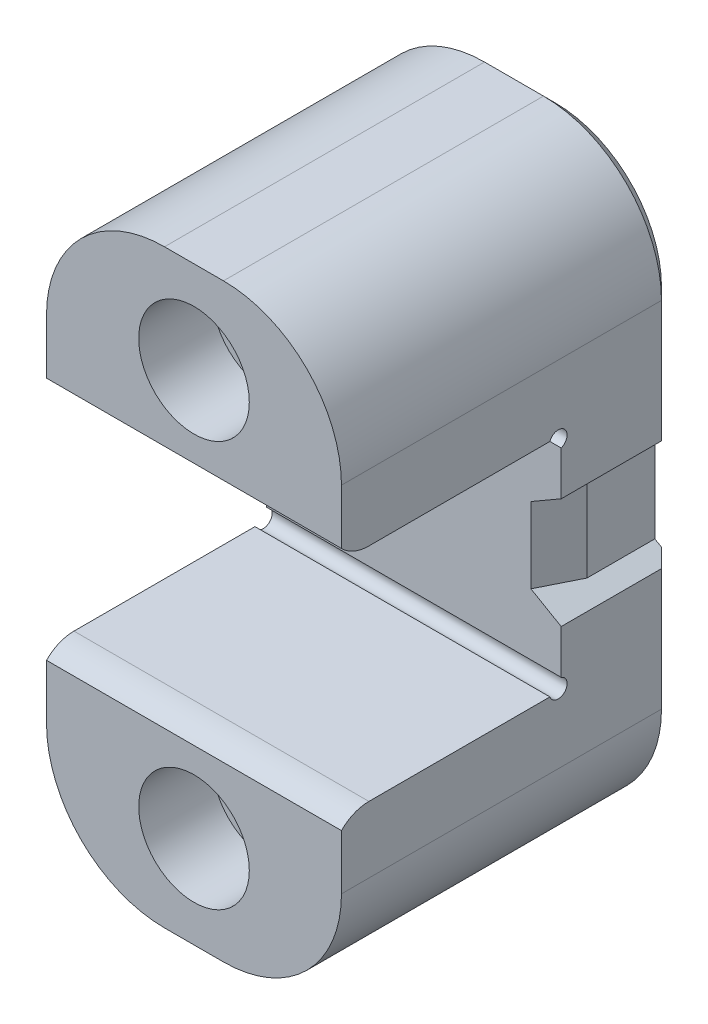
ISO-10303-21;
HEADER;
FILE_DESCRIPTION(('STEP AP214'),'2;1');
FILE_NAME('part.step','',(''),(''),'','','');
FILE_SCHEMA(('AUTOMOTIVE_DESIGN { 1 0 10303 214 1 1 1 1 }'));
ENDSEC;
DATA;
#1=APPLICATION_CONTEXT('core data for automotive mechanical design processes');
#2=APPLICATION_PROTOCOL_DEFINITION('international standard','automotive_design',2000,#1);
#3=PRODUCT_CONTEXT('',#1,'mechanical');
#4=PRODUCT('Part','Part','',(#3));
#5=PRODUCT_RELATED_PRODUCT_CATEGORY('part','',(#4));
#6=PRODUCT_DEFINITION_FORMATION('','',#4);
#7=PRODUCT_DEFINITION_CONTEXT('part definition',#1,'design');
#8=PRODUCT_DEFINITION('design','',#6,#7);
#9=PRODUCT_DEFINITION_SHAPE('','',#8);
#10=(LENGTH_UNIT() NAMED_UNIT(*) SI_UNIT(.MILLI.,.METRE.));
#11=(NAMED_UNIT(*) PLANE_ANGLE_UNIT() SI_UNIT($,.RADIAN.));
#12=(NAMED_UNIT(*) SI_UNIT($,.STERADIAN.) SOLID_ANGLE_UNIT());
#13=UNCERTAINTY_MEASURE_WITH_UNIT(LENGTH_MEASURE(1.E-05),#10,'distance_accuracy_value','');
#14=(GEOMETRIC_REPRESENTATION_CONTEXT(3) GLOBAL_UNCERTAINTY_ASSIGNED_CONTEXT((#13)) GLOBAL_UNIT_ASSIGNED_CONTEXT((#10,
#11,#12)) REPRESENTATION_CONTEXT('',''));
#15=CARTESIAN_POINT('',(0.,0.,0.));
#16=DIRECTION('',(0.,0.,1.));
#17=DIRECTION('',(1.,0.,0.));
#18=AXIS2_PLACEMENT_3D('',#15,#16,#17);
#19=CARTESIAN_POINT('',(12.7,9.525,-18.923));
#20=DIRECTION('',(0.,0.,-1.));
#21=DIRECTION('',(-1.,0.,0.));
#22=AXIS2_PLACEMENT_3D('',#19,#20,#21);
#23=PLANE('',#22);
#24=DIRECTION('',(0.866025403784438,-0.500000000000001,0.));
#25=VECTOR('',#24,1.);
#26=CARTESIAN_POINT('',(6.51333102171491,-1.19062499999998,-18.923));
#27=LINE('',#26,#25);
#28=CARTESIAN_POINT('',(10.0916135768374,-3.25654739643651,-18.923));
#29=VERTEX_POINT('',#28);
#30=CARTESIAN_POINT('',(12.7,-4.76249999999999,-18.923));
#31=VERTEX_POINT('',#30);
#32=EDGE_CURVE('E428',#29,#31,#27,.T.);
#33=ORIENTED_EDGE('',*,*,#32,.F.);
#34=DIRECTION('',(0.,1.,0.));
#35=VECTOR('',#34,1.);
#36=CARTESIAN_POINT('',(10.0916135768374,3.84595644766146,-18.923));
#37=LINE('',#36,#35);
#38=CARTESIAN_POINT('',(10.0916135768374,3.25654739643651,-18.923));
#39=VERTEX_POINT('',#38);
#40=EDGE_CURVE('E286',#29,#39,#37,.T.);
#41=ORIENTED_EDGE('',*,*,#40,.T.);
#42=DIRECTION('',(-0.866025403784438,-0.500000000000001,0.));
#43=VECTOR('',#42,1.);
#44=CARTESIAN_POINT('',(14.7622229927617,5.953125,-18.923));
#45=LINE('',#44,#43);
#46=CARTESIAN_POINT('',(12.7,4.76249999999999,-18.923));
#47=VERTEX_POINT('',#46);
#48=EDGE_CURVE('E426',#47,#39,#45,.T.);
#49=ORIENTED_EDGE('',*,*,#48,.F.);
#50=DIRECTION('',(0.,-1.,0.));
#51=VECTOR('',#50,1.);
#52=CARTESIAN_POINT('',(12.7,9.525,-18.923));
#53=LINE('',#52,#51);
#54=CARTESIAN_POINT('',(12.7,8.55257951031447,-18.923));
#55=VERTEX_POINT('',#54);
#56=EDGE_CURVE('E437',#55,#47,#53,.T.);
#57=ORIENTED_EDGE('',*,*,#56,.F.);
#58=DIRECTION('',(1.,0.,0.));
#59=VECTOR('',#58,1.);
#60=CARTESIAN_POINT('',(-12.7,8.55257951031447,-18.923));
#61=LINE('',#60,#59);
#62=CARTESIAN_POINT('',(-12.7,8.55257951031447,-18.923));
#63=VERTEX_POINT('',#62);
#64=EDGE_CURVE('E392',#55,#63,#61,.F.);
#65=ORIENTED_EDGE('',*,*,#64,.T.);
#66=DIRECTION('',(0.,-1.,0.));
#67=VECTOR('',#66,1.);
#68=CARTESIAN_POINT('',(-12.7,9.525,-18.923));
#69=LINE('',#68,#67);
#70=CARTESIAN_POINT('',(-12.7,-8.55257951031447,-18.923));
#71=VERTEX_POINT('',#70);
#72=EDGE_CURVE('E233',#63,#71,#69,.T.);
#73=ORIENTED_EDGE('',*,*,#72,.T.);
#74=DIRECTION('',(1.,0.,0.));
#75=VECTOR('',#74,1.);
#76=CARTESIAN_POINT('',(-12.7,-8.55257951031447,-18.923));
#77=LINE('',#76,#75);
#78=CARTESIAN_POINT('',(12.7,-8.55257951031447,-18.923));
#79=VERTEX_POINT('',#78);
#80=EDGE_CURVE('E213',#71,#79,#77,.T.);
#81=ORIENTED_EDGE('',*,*,#80,.T.);
#82=EDGE_CURVE('E436',#31,#79,#53,.T.);
#83=ORIENTED_EDGE('',*,*,#82,.F.);
#84=EDGE_LOOP('',(#33,#41,#49,#57,#65,#73,#81,#83));
#85=FACE_BOUND('',#84,.T.);
#86=ADVANCED_FACE('F33',(#85),#23,.F.);
#87=CARTESIAN_POINT('',(12.7,25.4,-28.575));
#88=DIRECTION('',(0.,0.,1.));
#89=DIRECTION('',(1.,0.,0.));
#90=AXIS2_PLACEMENT_3D('',#87,#88,#89);
#91=PLANE('',#90);
#92=DIRECTION('',(0.866025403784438,-0.500000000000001,0.));
#93=VECTOR('',#92,1.);
#94=CARTESIAN_POINT('',(11.1125,-3.84595644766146,-28.575));
#95=LINE('',#94,#93);
#96=CARTESIAN_POINT('',(11.1125,-3.84595644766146,-28.575));
#97=VERTEX_POINT('',#96);
#98=CARTESIAN_POINT('',(11.684,-4.17591212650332,-28.575));
#99=VERTEX_POINT('',#98);
#100=EDGE_CURVE('E416',#97,#99,#95,.T.);
#101=ORIENTED_EDGE('',*,*,#100,.T.);
#102=DIRECTION('',(0.,-1.,0.));
#103=VECTOR('',#102,1.);
#104=CARTESIAN_POINT('',(11.684,25.4,-28.575));
#105=LINE('',#104,#103);
#106=CARTESIAN_POINT('',(11.684,-15.24,-28.575));
#107=VERTEX_POINT('',#106);
#108=EDGE_CURVE('E315',#99,#107,#105,.T.);
#109=ORIENTED_EDGE('',*,*,#108,.T.);
#110=CARTESIAN_POINT('',(2.54,-15.24,-28.575));
#111=DIRECTION('',(0.,0.,1.));
#112=DIRECTION('',(1.,0.,0.));
#113=AXIS2_PLACEMENT_3D('',#110,#111,#112);
#114=CIRCLE('',#113,9.14399999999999);
#115=CARTESIAN_POINT('',(2.54,-24.384,-28.575));
#116=VERTEX_POINT('',#115);
#117=EDGE_CURVE('E311',#107,#116,#114,.F.);
#118=ORIENTED_EDGE('',*,*,#117,.T.);
#119=DIRECTION('',(-1.,0.,0.));
#120=VECTOR('',#119,1.);
#121=CARTESIAN_POINT('',(12.7,-24.384,-28.575));
#122=LINE('',#121,#120);
#123=CARTESIAN_POINT('',(-2.54,-24.384,-28.575));
#124=VERTEX_POINT('',#123);
#125=EDGE_CURVE('E307',#116,#124,#122,.T.);
#126=ORIENTED_EDGE('',*,*,#125,.T.);
#127=CARTESIAN_POINT('',(-2.54,-15.24,-28.575));
#128=DIRECTION('',(0.,0.,1.));
#129=DIRECTION('',(1.,0.,0.));
#130=AXIS2_PLACEMENT_3D('',#127,#128,#129);
#131=CIRCLE('',#130,9.14399999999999);
#132=CARTESIAN_POINT('',(-11.684,-15.24,-28.575));
#133=VERTEX_POINT('',#132);
#134=EDGE_CURVE('E305',#124,#133,#131,.F.);
#135=ORIENTED_EDGE('',*,*,#134,.T.);
#136=DIRECTION('',(0.,1.,0.));
#137=VECTOR('',#136,1.);
#138=CARTESIAN_POINT('',(-11.684,15.24,-28.575));
#139=LINE('',#138,#137);
#140=CARTESIAN_POINT('',(-11.684,15.24,-28.575));
#141=VERTEX_POINT('',#140);
#142=EDGE_CURVE('E301',#133,#141,#139,.T.);
#143=ORIENTED_EDGE('',*,*,#142,.T.);
#144=CARTESIAN_POINT('',(-2.54,15.24,-28.575));
#145=DIRECTION('',(0.,0.,1.));
#146=DIRECTION('',(1.,0.,0.));
#147=AXIS2_PLACEMENT_3D('',#144,#145,#146);
#148=CIRCLE('',#147,9.14399999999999);
#149=CARTESIAN_POINT('',(-2.54,24.384,-28.575));
#150=VERTEX_POINT('',#149);
#151=EDGE_CURVE('E299',#141,#150,#148,.F.);
#152=ORIENTED_EDGE('',*,*,#151,.T.);
#153=DIRECTION('',(1.,0.,0.));
#154=VECTOR('',#153,1.);
#155=CARTESIAN_POINT('',(12.7,24.384,-28.575));
#156=LINE('',#155,#154);
#157=CARTESIAN_POINT('',(2.54,24.384,-28.575));
#158=VERTEX_POINT('',#157);
#159=EDGE_CURVE('E303',#150,#158,#156,.T.);
#160=ORIENTED_EDGE('',*,*,#159,.T.);
#161=CARTESIAN_POINT('',(2.54,15.24,-28.575));
#162=DIRECTION('',(0.,0.,1.));
#163=DIRECTION('',(1.,0.,0.));
#164=AXIS2_PLACEMENT_3D('',#161,#162,#163);
#165=CIRCLE('',#164,9.14399999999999);
#166=CARTESIAN_POINT('',(11.684,15.24,-28.575));
#167=VERTEX_POINT('',#166);
#168=EDGE_CURVE('E309',#158,#167,#165,.F.);
#169=ORIENTED_EDGE('',*,*,#168,.T.);
#170=DIRECTION('',(0.,-1.,0.));
#171=VECTOR('',#170,1.);
#172=CARTESIAN_POINT('',(11.684,25.4,-28.575));
#173=LINE('',#172,#171);
#174=CARTESIAN_POINT('',(11.684,4.17591212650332,-28.575));
#175=VERTEX_POINT('',#174);
#176=EDGE_CURVE('E313',#167,#175,#173,.T.);
#177=ORIENTED_EDGE('',*,*,#176,.T.);
#178=DIRECTION('',(-0.866025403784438,-0.500000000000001,0.));
#179=VECTOR('',#178,1.);
#180=CARTESIAN_POINT('',(11.1125,3.84595644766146,-28.575));
#181=LINE('',#180,#179);
#182=CARTESIAN_POINT('',(11.1125,3.84595644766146,-28.575));
#183=VERTEX_POINT('',#182);
#184=EDGE_CURVE('E419',#175,#183,#181,.T.);
#185=ORIENTED_EDGE('',*,*,#184,.T.);
#186=DIRECTION('',(0.,-1.,0.));
#187=VECTOR('',#186,1.);
#188=CARTESIAN_POINT('',(11.1125,3.84595644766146,-28.575));
#189=LINE('',#188,#187);
#190=EDGE_CURVE('E412',#183,#97,#189,.T.);
#191=ORIENTED_EDGE('',*,*,#190,.T.);
#192=EDGE_LOOP('',(#101,#109,#118,#126,#135,#143,#152,#160,#169,#177,#185,#191));
#193=FACE_BOUND('',#192,.T.);
#194=CARTESIAN_POINT('',(0.,-17.4625,-28.575));
#195=DIRECTION('',(0.,0.,1.));
#196=DIRECTION('',(1.,0.,0.));
#197=AXIS2_PLACEMENT_3D('',#194,#195,#196);
#198=CIRCLE('',#197,2.55269999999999);
#199=CARTESIAN_POINT('',(2.55269999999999,-17.4625,-28.575));
#200=VERTEX_POINT('',#199);
#201=EDGE_CURVE('E360',#200,#200,#198,.T.);
#202=ORIENTED_EDGE('',*,*,#201,.T.);
#203=EDGE_LOOP('',(#202));
#204=FACE_BOUND('',#203,.T.);
#205=CARTESIAN_POINT('',(0.,17.4625,-28.575));
#206=DIRECTION('',(0.,0.,1.));
#207=DIRECTION('',(1.,0.,0.));
#208=AXIS2_PLACEMENT_3D('',#205,#206,#207);
#209=CIRCLE('',#208,2.55269999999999);
#210=CARTESIAN_POINT('',(2.55269999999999,17.4625,-28.575));
#211=VERTEX_POINT('',#210);
#212=EDGE_CURVE('E370',#211,#211,#209,.T.);
#213=ORIENTED_EDGE('',*,*,#212,.T.);
#214=EDGE_LOOP('',(#213));
#215=FACE_BOUND('',#214,.T.);
#216=ADVANCED_FACE('F546',(#193,#204,#215),#91,.F.);
#217=CARTESIAN_POINT('',(12.7,-9.525,0.));
#218=DIRECTION('',(-1.,0.,0.));
#219=DIRECTION('',(0.,0.,1.));
#220=AXIS2_PLACEMENT_3D('',#217,#218,#219);
#221=PLANE('',#220);
#222=DIRECTION('',(0.,0.,-1.));
#223=VECTOR('',#222,1.);
#224=CARTESIAN_POINT('',(12.7,-15.24,0.));
#225=LINE('',#224,#223);
#226=CARTESIAN_POINT('',(12.7,-15.24,0.));
#227=VERTEX_POINT('',#226);
#228=CARTESIAN_POINT('',(12.7,-15.24,-27.559));
#229=VERTEX_POINT('',#228);
#230=EDGE_CURVE('E251',#227,#229,#225,.T.);
#231=ORIENTED_EDGE('',*,*,#230,.T.);
#232=DIRECTION('',(0.,1.,0.));
#233=VECTOR('',#232,1.);
#234=CARTESIAN_POINT('',(12.7,-9.525,-27.559));
#235=LINE('',#234,#233);
#236=CARTESIAN_POINT('',(12.7,-4.76249999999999,-27.559));
#237=VERTEX_POINT('',#236);
#238=EDGE_CURVE('E294',#229,#237,#235,.T.);
#239=ORIENTED_EDGE('',*,*,#238,.T.);
#240=DIRECTION('',(0.,0.,-1.));
#241=VECTOR('',#240,1.);
#242=CARTESIAN_POINT('',(12.7,-4.76249999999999,0.));
#243=LINE('',#242,#241);
#244=EDGE_CURVE('E278',#31,#237,#243,.T.);
#245=ORIENTED_EDGE('',*,*,#244,.F.);
#246=ORIENTED_EDGE('',*,*,#82,.T.);
#247=CARTESIAN_POINT('',(12.7,-9.271,-18.669));
#248=DIRECTION('',(1.,0.,0.));
#249=DIRECTION('',(0.,0.,1.));
#250=AXIS2_PLACEMENT_3D('',#247,#248,#249);
#251=CIRCLE('',#250,0.761999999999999);
#252=CARTESIAN_POINT('',(12.7,-9.525,-17.9505795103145));
#253=VERTEX_POINT('',#252);
#254=EDGE_CURVE('E218',#253,#79,#251,.T.);
#255=ORIENTED_EDGE('',*,*,#254,.F.);
#256=DIRECTION('',(0.,0.,1.));
#257=VECTOR('',#256,1.);
#258=CARTESIAN_POINT('',(12.7,-9.525,-18.923));
#259=LINE('',#258,#257);
#260=CARTESIAN_POINT('',(12.7,-9.525,-2.36219999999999));
#261=VERTEX_POINT('',#260);
#262=EDGE_CURVE('E226',#253,#261,#259,.T.);
#263=ORIENTED_EDGE('',*,*,#262,.T.);
#264=CARTESIAN_POINT('',(12.7,-12.8241534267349,-2.36219999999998));
#265=DIRECTION('',(-1.,0.,0.));
#266=DIRECTION('',(0.,0.,1.));
#267=AXIS2_PLACEMENT_3D('',#264,#265,#266);
#268=CIRCLE('',#267,3.29915342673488);
#269=CARTESIAN_POINT('',(12.7,-10.5210198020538,0.));
#270=VERTEX_POINT('',#269);
#271=EDGE_CURVE('E403',#270,#261,#268,.T.);
#272=ORIENTED_EDGE('',*,*,#271,.F.);
#273=DIRECTION('',(0.,-1.,0.));
#274=VECTOR('',#273,1.);
#275=CARTESIAN_POINT('',(12.7,-9.525,0.));
#276=LINE('',#275,#274);
#277=EDGE_CURVE('E246',#270,#227,#276,.T.);
#278=ORIENTED_EDGE('',*,*,#277,.T.);
#279=EDGE_LOOP('',(#231,#239,#245,#246,#255,#263,#272,#278));
#280=FACE_BOUND('',#279,.T.);
#281=ADVANCED_FACE('F523',(#280),#221,.F.);
#282=DIRECTION('',(0.,0.,1.));
#283=VECTOR('',#282,1.);
#284=CARTESIAN_POINT('',(12.7,4.76249999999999,0.));
#285=LINE('',#284,#283);
#286=CARTESIAN_POINT('',(12.7,4.76249999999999,-27.559));
#287=VERTEX_POINT('',#286);
#288=EDGE_CURVE('E276',#287,#47,#285,.T.);
#289=ORIENTED_EDGE('',*,*,#288,.F.);
#290=DIRECTION('',(0.,1.,0.));
#291=VECTOR('',#290,1.);
#292=CARTESIAN_POINT('',(12.7,-9.525,-27.559));
#293=LINE('',#292,#291);
#294=CARTESIAN_POINT('',(12.7,15.24,-27.559));
#295=VERTEX_POINT('',#294);
#296=EDGE_CURVE('E317',#287,#295,#293,.T.);
#297=ORIENTED_EDGE('',*,*,#296,.T.);
#298=DIRECTION('',(0.,0.,1.));
#299=VECTOR('',#298,1.);
#300=CARTESIAN_POINT('',(12.7,15.24,0.));
#301=LINE('',#300,#299);
#302=CARTESIAN_POINT('',(12.7,15.24,0.));
#303=VERTEX_POINT('',#302);
#304=EDGE_CURVE('E249',#295,#303,#301,.T.);
#305=ORIENTED_EDGE('',*,*,#304,.T.);
#306=DIRECTION('',(0.,-1.,0.));
#307=VECTOR('',#306,1.);
#308=CARTESIAN_POINT('',(12.7,25.4,0.));
#309=LINE('',#308,#307);
#310=CARTESIAN_POINT('',(12.7,10.5210198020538,0.));
#311=VERTEX_POINT('',#310);
#312=EDGE_CURVE('E236',#303,#311,#309,.T.);
#313=ORIENTED_EDGE('',*,*,#312,.T.);
#314=CARTESIAN_POINT('',(12.7,12.8241534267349,-2.36219999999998));
#315=DIRECTION('',(-1.,0.,0.));
#316=DIRECTION('',(0.,0.,-1.));
#317=AXIS2_PLACEMENT_3D('',#314,#315,#316);
#318=CIRCLE('',#317,3.29915342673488);
#319=CARTESIAN_POINT('',(12.7,9.525,-2.36219999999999));
#320=VERTEX_POINT('',#319);
#321=EDGE_CURVE('E395',#320,#311,#318,.T.);
#322=ORIENTED_EDGE('',*,*,#321,.F.);
#323=DIRECTION('',(0.,0.,-1.));
#324=VECTOR('',#323,1.);
#325=CARTESIAN_POINT('',(12.7,9.525,0.));
#326=LINE('',#325,#324);
#327=CARTESIAN_POINT('',(12.7,9.525,-17.9505795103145));
#328=VERTEX_POINT('',#327);
#329=EDGE_CURVE('E433',#320,#328,#326,.T.);
#330=ORIENTED_EDGE('',*,*,#329,.T.);
#331=CARTESIAN_POINT('',(12.7,9.271,-18.669));
#332=DIRECTION('',(1.,0.,0.));
#333=DIRECTION('',(0.,0.,-1.));
#334=AXIS2_PLACEMENT_3D('',#331,#332,#333);
#335=CIRCLE('',#334,0.761999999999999);
#336=EDGE_CURVE('E387',#55,#328,#335,.T.);
#337=ORIENTED_EDGE('',*,*,#336,.F.);
#338=ORIENTED_EDGE('',*,*,#56,.T.);
#339=EDGE_LOOP('',(#289,#297,#305,#313,#322,#330,#337,#338));
#340=FACE_BOUND('',#339,.T.);
#341=ADVANCED_FACE('F459',(#340),#221,.F.);
#342=CARTESIAN_POINT('',(12.7,25.4,0.));
#343=DIRECTION('',(0.,0.,-1.));
#344=DIRECTION('',(0.,1.,0.));
#345=AXIS2_PLACEMENT_3D('',#342,#343,#344);
#346=PLANE('',#345);
#347=CARTESIAN_POINT('',(0.,17.4625,0.));
#348=DIRECTION('',(0.,0.,1.));
#349=DIRECTION('',(1.,0.,0.));
#350=AXIS2_PLACEMENT_3D('',#347,#348,#349);
#351=CIRCLE('',#350,4.7625);
#352=CARTESIAN_POINT('',(4.7625,17.4625,0.));
#353=VERTEX_POINT('',#352);
#354=EDGE_CURVE('E373',#353,#353,#351,.T.);
#355=ORIENTED_EDGE('',*,*,#354,.F.);
#356=EDGE_LOOP('',(#355));
#357=FACE_BOUND('',#356,.T.);
#358=DIRECTION('',(0.,-1.,0.));
#359=VECTOR('',#358,1.);
#360=CARTESIAN_POINT('',(-12.7,25.4,0.));
#361=LINE('',#360,#359);
#362=CARTESIAN_POINT('',(-12.7,15.24,0.));
#363=VERTEX_POINT('',#362);
#364=CARTESIAN_POINT('',(-12.7,10.5210198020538,0.));
#365=VERTEX_POINT('',#364);
#366=EDGE_CURVE('E430',#363,#365,#361,.T.);
#367=ORIENTED_EDGE('',*,*,#366,.T.);
#368=DIRECTION('',(1.,0.,0.));
#369=VECTOR('',#368,1.);
#370=CARTESIAN_POINT('',(-12.7,10.5210198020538,0.));
#371=LINE('',#370,#369);
#372=EDGE_CURVE('E399',#365,#311,#371,.T.);
#373=ORIENTED_EDGE('',*,*,#372,.T.);
#374=ORIENTED_EDGE('',*,*,#312,.F.);
#375=CARTESIAN_POINT('',(2.54,15.24,0.));
#376=DIRECTION('',(0.,0.,-1.));
#377=DIRECTION('',(0.,1.,0.));
#378=AXIS2_PLACEMENT_3D('',#375,#376,#377);
#379=CIRCLE('',#378,10.16);
#380=CARTESIAN_POINT('',(2.54,25.4,0.));
#381=VERTEX_POINT('',#380);
#382=EDGE_CURVE('E266',#303,#381,#379,.F.);
#383=ORIENTED_EDGE('',*,*,#382,.T.);
#384=DIRECTION('',(-1.,0.,0.));
#385=VECTOR('',#384,1.);
#386=CARTESIAN_POINT('',(12.7,25.4,0.));
#387=LINE('',#386,#385);
#388=CARTESIAN_POINT('',(-2.54,25.4,0.));
#389=VERTEX_POINT('',#388);
#390=EDGE_CURVE('E242',#381,#389,#387,.T.);
#391=ORIENTED_EDGE('',*,*,#390,.T.);
#392=CARTESIAN_POINT('',(-2.54,15.24,0.));
#393=DIRECTION('',(0.,0.,-1.));
#394=DIRECTION('',(0.,1.,0.));
#395=AXIS2_PLACEMENT_3D('',#392,#393,#394);
#396=CIRCLE('',#395,10.16);
#397=EDGE_CURVE('E264',#389,#363,#396,.F.);
#398=ORIENTED_EDGE('',*,*,#397,.T.);
#399=EDGE_LOOP('',(#367,#373,#374,#383,#391,#398));
#400=FACE_BOUND('',#399,.T.);
#401=ADVANCED_FACE('F466',(#357,#400),#346,.F.);
#402=CARTESIAN_POINT('',(12.7,9.525,0.));
#403=DIRECTION('',(0.,1.,0.));
#404=DIRECTION('',(0.,0.,1.));
#405=AXIS2_PLACEMENT_3D('',#402,#403,#404);
#406=PLANE('',#405);
#407=DIRECTION('',(0.,0.,-1.));
#408=VECTOR('',#407,1.);
#409=CARTESIAN_POINT('',(-12.7,9.525,0.));
#410=LINE('',#409,#408);
#411=CARTESIAN_POINT('',(-12.7,9.525,-2.36219999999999));
#412=VERTEX_POINT('',#411);
#413=CARTESIAN_POINT('',(-12.7,9.525,-17.9505795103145));
#414=VERTEX_POINT('',#413);
#415=EDGE_CURVE('E238',#412,#414,#410,.T.);
#416=ORIENTED_EDGE('',*,*,#415,.T.);
#417=DIRECTION('',(1.,0.,0.));
#418=VECTOR('',#417,1.);
#419=CARTESIAN_POINT('',(-12.7,9.525,-17.9505795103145));
#420=LINE('',#419,#418);
#421=EDGE_CURVE('E389',#414,#328,#420,.T.);
#422=ORIENTED_EDGE('',*,*,#421,.T.);
#423=ORIENTED_EDGE('',*,*,#329,.F.);
#424=DIRECTION('',(1.,0.,0.));
#425=VECTOR('',#424,1.);
#426=CARTESIAN_POINT('',(-12.7,9.525,-2.36219999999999));
#427=LINE('',#426,#425);
#428=EDGE_CURVE('E401',#412,#320,#427,.T.);
#429=ORIENTED_EDGE('',*,*,#428,.F.);
#430=EDGE_LOOP('',(#416,#422,#423,#429));
#431=FACE_BOUND('',#430,.T.);
#432=ADVANCED_FACE('F447',(#431),#406,.F.);
#433=CARTESIAN_POINT('',(12.7,-9.525,-18.923));
#434=DIRECTION('',(0.,-1.,0.));
#435=DIRECTION('',(0.,0.,-1.));
#436=AXIS2_PLACEMENT_3D('',#433,#434,#435);
#437=PLANE('',#436);
#438=ORIENTED_EDGE('',*,*,#262,.F.);
#439=DIRECTION('',(1.,0.,0.));
#440=VECTOR('',#439,1.);
#441=CARTESIAN_POINT('',(-12.7,-9.525,-17.9505795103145));
#442=LINE('',#441,#440);
#443=CARTESIAN_POINT('',(-12.7,-9.525,-17.9505795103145));
#444=VERTEX_POINT('',#443);
#445=EDGE_CURVE('E210',#253,#444,#442,.F.);
#446=ORIENTED_EDGE('',*,*,#445,.T.);
#447=DIRECTION('',(0.,0.,1.));
#448=VECTOR('',#447,1.);
#449=CARTESIAN_POINT('',(-12.7,-9.525,-18.923));
#450=LINE('',#449,#448);
#451=CARTESIAN_POINT('',(-12.7,-9.525,-2.36219999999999));
#452=VERTEX_POINT('',#451);
#453=EDGE_CURVE('E224',#444,#452,#450,.T.);
#454=ORIENTED_EDGE('',*,*,#453,.T.);
#455=DIRECTION('',(1.,0.,0.));
#456=VECTOR('',#455,1.);
#457=CARTESIAN_POINT('',(-12.7,-9.525,-2.36219999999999));
#458=LINE('',#457,#456);
#459=EDGE_CURVE('E407',#452,#261,#458,.T.);
#460=ORIENTED_EDGE('',*,*,#459,.T.);
#461=EDGE_LOOP('',(#438,#446,#454,#460));
#462=FACE_BOUND('',#461,.T.);
#463=ADVANCED_FACE('F222',(#462),#437,.F.);
#464=CARTESIAN_POINT('',(12.7,-9.525,0.));
#465=DIRECTION('',(0.,0.,-1.));
#466=DIRECTION('',(0.,1.,0.));
#467=AXIS2_PLACEMENT_3D('',#464,#465,#466);
#468=PLANE('',#467);
#469=CARTESIAN_POINT('',(0.,-17.4625,0.));
#470=DIRECTION('',(0.,0.,1.));
#471=DIRECTION('',(1.,0.,0.));
#472=AXIS2_PLACEMENT_3D('',#469,#470,#471);
#473=CIRCLE('',#472,4.7625);
#474=CARTESIAN_POINT('',(4.7625,-17.4625,0.));
#475=VERTEX_POINT('',#474);
#476=EDGE_CURVE('E379',#475,#475,#473,.T.);
#477=ORIENTED_EDGE('',*,*,#476,.F.);
#478=EDGE_LOOP('',(#477));
#479=FACE_BOUND('',#478,.T.);
#480=ORIENTED_EDGE('',*,*,#277,.F.);
#481=DIRECTION('',(1.,0.,0.));
#482=VECTOR('',#481,1.);
#483=CARTESIAN_POINT('',(-12.7,-10.5210198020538,0.));
#484=LINE('',#483,#482);
#485=CARTESIAN_POINT('',(-12.7,-10.5210198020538,0.));
#486=VERTEX_POINT('',#485);
#487=EDGE_CURVE('E410',#486,#270,#484,.T.);
#488=ORIENTED_EDGE('',*,*,#487,.F.);
#489=DIRECTION('',(0.,-1.,0.));
#490=VECTOR('',#489,1.);
#491=CARTESIAN_POINT('',(-12.7,-9.525,0.));
#492=LINE('',#491,#490);
#493=CARTESIAN_POINT('',(-12.7,-15.24,0.));
#494=VERTEX_POINT('',#493);
#495=EDGE_CURVE('E232',#486,#494,#492,.T.);
#496=ORIENTED_EDGE('',*,*,#495,.T.);
#497=CARTESIAN_POINT('',(-2.54,-15.24,0.));
#498=DIRECTION('',(0.,0.,-1.));
#499=DIRECTION('',(0.,1.,0.));
#500=AXIS2_PLACEMENT_3D('',#497,#498,#499);
#501=CIRCLE('',#500,10.16);
#502=CARTESIAN_POINT('',(-2.54,-25.4,0.));
#503=VERTEX_POINT('',#502);
#504=EDGE_CURVE('E259',#494,#503,#501,.F.);
#505=ORIENTED_EDGE('',*,*,#504,.T.);
#506=DIRECTION('',(-1.,0.,0.));
#507=VECTOR('',#506,1.);
#508=CARTESIAN_POINT('',(12.7,-25.4,0.));
#509=LINE('',#508,#507);
#510=CARTESIAN_POINT('',(2.54,-25.4,0.));
#511=VERTEX_POINT('',#510);
#512=EDGE_CURVE('E245',#511,#503,#509,.T.);
#513=ORIENTED_EDGE('',*,*,#512,.F.);
#514=CARTESIAN_POINT('',(2.54,-15.24,0.));
#515=DIRECTION('',(0.,0.,-1.));
#516=DIRECTION('',(0.,1.,0.));
#517=AXIS2_PLACEMENT_3D('',#514,#515,#516);
#518=CIRCLE('',#517,10.16);
#519=EDGE_CURVE('E261',#511,#227,#518,.F.);
#520=ORIENTED_EDGE('',*,*,#519,.T.);
#521=EDGE_LOOP('',(#480,#488,#496,#505,#513,#520));
#522=FACE_BOUND('',#521,.T.);
#523=ADVANCED_FACE('F497',(#479,#522),#468,.F.);
#524=CARTESIAN_POINT('',(12.7,-25.4,0.));
#525=DIRECTION('',(0.,1.,0.));
#526=DIRECTION('',(0.,0.,1.));
#527=AXIS2_PLACEMENT_3D('',#524,#525,#526);
#528=PLANE('',#527);
#529=DIRECTION('',(0.,0.,-1.));
#530=VECTOR('',#529,1.);
#531=CARTESIAN_POINT('',(-2.54,-25.4,-28.575));
#532=LINE('',#531,#530);
#533=CARTESIAN_POINT('',(-2.54,-25.4,-27.559));
#534=VERTEX_POINT('',#533);
#535=EDGE_CURVE('E254',#503,#534,#532,.T.);
#536=ORIENTED_EDGE('',*,*,#535,.T.);
#537=DIRECTION('',(1.,0.,0.));
#538=VECTOR('',#537,1.);
#539=CARTESIAN_POINT('',(12.7,-25.4,-27.559));
#540=LINE('',#539,#538);
#541=CARTESIAN_POINT('',(2.54,-25.4,-27.559));
#542=VERTEX_POINT('',#541);
#543=EDGE_CURVE('E325',#534,#542,#540,.T.);
#544=ORIENTED_EDGE('',*,*,#543,.T.);
#545=DIRECTION('',(0.,0.,-1.));
#546=VECTOR('',#545,1.);
#547=CARTESIAN_POINT('',(2.54,-25.4,0.));
#548=LINE('',#547,#546);
#549=EDGE_CURVE('E257',#542,#511,#548,.F.);
#550=ORIENTED_EDGE('',*,*,#549,.T.);
#551=ORIENTED_EDGE('',*,*,#512,.T.);
#552=EDGE_LOOP('',(#536,#544,#550,#551));
#553=FACE_BOUND('',#552,.T.);
#554=ADVANCED_FACE('F501',(#553),#528,.F.);
#555=CARTESIAN_POINT('',(12.7,25.4,0.));
#556=DIRECTION('',(0.,-1.,0.));
#557=DIRECTION('',(0.,0.,-1.));
#558=AXIS2_PLACEMENT_3D('',#555,#556,#557);
#559=PLANE('',#558);
#560=DIRECTION('',(0.,0.,1.));
#561=VECTOR('',#560,1.);
#562=CARTESIAN_POINT('',(2.54,25.4,0.));
#563=LINE('',#562,#561);
#564=CARTESIAN_POINT('',(2.54,25.4,-27.559));
#565=VERTEX_POINT('',#564);
#566=EDGE_CURVE('E270',#381,#565,#563,.F.);
#567=ORIENTED_EDGE('',*,*,#566,.T.);
#568=DIRECTION('',(-1.,0.,0.));
#569=VECTOR('',#568,1.);
#570=CARTESIAN_POINT('',(12.7,25.4,-27.559));
#571=LINE('',#570,#569);
#572=CARTESIAN_POINT('',(-2.54,25.4,-27.559));
#573=VERTEX_POINT('',#572);
#574=EDGE_CURVE('E56',#565,#573,#571,.T.);
#575=ORIENTED_EDGE('',*,*,#574,.T.);
#576=DIRECTION('',(0.,0.,1.));
#577=VECTOR('',#576,1.);
#578=CARTESIAN_POINT('',(-2.54,25.4,0.));
#579=LINE('',#578,#577);
#580=EDGE_CURVE('E268',#573,#389,#579,.T.);
#581=ORIENTED_EDGE('',*,*,#580,.T.);
#582=ORIENTED_EDGE('',*,*,#390,.F.);
#583=EDGE_LOOP('',(#567,#575,#581,#582));
#584=FACE_BOUND('',#583,.T.);
#585=ADVANCED_FACE('F474',(#584),#559,.F.);
#586=CARTESIAN_POINT('',(-12.7,-9.525,0.));
#587=DIRECTION('',(-1.,0.,0.));
#588=DIRECTION('',(0.,0.,1.));
#589=AXIS2_PLACEMENT_3D('',#586,#587,#588);
#590=PLANE('',#589);
#591=DIRECTION('',(0.,0.,1.));
#592=VECTOR('',#591,1.);
#593=CARTESIAN_POINT('',(-12.7,15.24,-28.575));
#594=LINE('',#593,#592);
#595=CARTESIAN_POINT('',(-12.7,15.24,-27.559));
#596=VERTEX_POINT('',#595);
#597=EDGE_CURVE('E272',#363,#596,#594,.F.);
#598=ORIENTED_EDGE('',*,*,#597,.T.);
#599=DIRECTION('',(0.,-1.,0.));
#600=VECTOR('',#599,1.);
#601=CARTESIAN_POINT('',(-12.7,-15.24,-27.559));
#602=LINE('',#601,#600);
#603=CARTESIAN_POINT('',(-12.7,-15.24,-27.559));
#604=VERTEX_POINT('',#603);
#605=EDGE_CURVE('E42',#596,#604,#602,.T.);
#606=ORIENTED_EDGE('',*,*,#605,.T.);
#607=DIRECTION('',(0.,0.,-1.));
#608=VECTOR('',#607,1.);
#609=CARTESIAN_POINT('',(-12.7,-15.24,0.));
#610=LINE('',#609,#608);
#611=EDGE_CURVE('E274',#604,#494,#610,.F.);
#612=ORIENTED_EDGE('',*,*,#611,.T.);
#613=ORIENTED_EDGE('',*,*,#495,.F.);
#614=CARTESIAN_POINT('',(-12.7,-12.8241534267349,-2.36219999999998));
#615=DIRECTION('',(-1.,0.,0.));
#616=DIRECTION('',(0.,0.,1.));
#617=AXIS2_PLACEMENT_3D('',#614,#615,#616);
#618=CIRCLE('',#617,3.29915342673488);
#619=EDGE_CURVE('E231',#486,#452,#618,.T.);
#620=ORIENTED_EDGE('',*,*,#619,.T.);
#621=ORIENTED_EDGE('',*,*,#453,.F.);
#622=CARTESIAN_POINT('',(-12.7,-9.271,-18.669));
#623=DIRECTION('',(1.,0.,0.));
#624=DIRECTION('',(0.,0.,1.));
#625=AXIS2_PLACEMENT_3D('',#622,#623,#624);
#626=CIRCLE('',#625,0.761999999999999);
#627=EDGE_CURVE('E207',#444,#71,#626,.T.);
#628=ORIENTED_EDGE('',*,*,#627,.T.);
#629=ORIENTED_EDGE('',*,*,#72,.F.);
#630=CARTESIAN_POINT('',(-12.7,9.271,-18.669));
#631=DIRECTION('',(-1.,0.,0.));
#632=DIRECTION('',(0.,0.,1.));
#633=AXIS2_PLACEMENT_3D('',#630,#631,#632);
#634=CIRCLE('',#633,0.761999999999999);
#635=EDGE_CURVE('E281',#414,#63,#634,.T.);
#636=ORIENTED_EDGE('',*,*,#635,.F.);
#637=ORIENTED_EDGE('',*,*,#415,.F.);
#638=CARTESIAN_POINT('',(-12.7,12.8241534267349,-2.36219999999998));
#639=DIRECTION('',(-1.,0.,0.));
#640=DIRECTION('',(0.,0.,-1.));
#641=AXIS2_PLACEMENT_3D('',#638,#639,#640);
#642=CIRCLE('',#641,3.29915342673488);
#643=EDGE_CURVE('E396',#412,#365,#642,.T.);
#644=ORIENTED_EDGE('',*,*,#643,.T.);
#645=ORIENTED_EDGE('',*,*,#366,.F.);
#646=EDGE_LOOP('',(#598,#606,#612,#613,#620,#621,#628,#629,#636,#637,#644,#645));
#647=FACE_BOUND('',#646,.T.);
#648=ADVANCED_FACE('F229',(#647),#590,.T.);
#649=CARTESIAN_POINT('',(2.54,-15.24,0.));
#650=DIRECTION('',(0.,0.,-1.));
#651=DIRECTION('',(-1.,0.,0.));
#652=AXIS2_PLACEMENT_3D('',#649,#650,#651);
#653=CYLINDRICAL_SURFACE('',#652,10.16);
#654=ORIENTED_EDGE('',*,*,#549,.F.);
#655=CARTESIAN_POINT('',(2.54,-15.24,-27.559));
#656=DIRECTION('',(0.,0.,1.));
#657=DIRECTION('',(1.,0.,0.));
#658=AXIS2_PLACEMENT_3D('',#655,#656,#657);
#659=CIRCLE('',#658,10.16);
#660=EDGE_CURVE('E321',#542,#229,#659,.T.);
#661=ORIENTED_EDGE('',*,*,#660,.T.);
#662=ORIENTED_EDGE('',*,*,#230,.F.);
#663=ORIENTED_EDGE('',*,*,#519,.F.);
#664=EDGE_LOOP('',(#654,#661,#662,#663));
#665=FACE_BOUND('',#664,.T.);
#666=ADVANCED_FACE('F507',(#665),#653,.T.);
#667=CARTESIAN_POINT('',(2.54,15.24,0.));
#668=DIRECTION('',(0.,0.,1.));
#669=DIRECTION('',(1.,0.,0.));
#670=AXIS2_PLACEMENT_3D('',#667,#668,#669);
#671=CYLINDRICAL_SURFACE('',#670,10.16);
#672=ORIENTED_EDGE('',*,*,#304,.F.);
#673=CARTESIAN_POINT('',(2.54,15.24,-27.559));
#674=DIRECTION('',(0.,0.,1.));
#675=DIRECTION('',(1.,0.,0.));
#676=AXIS2_PLACEMENT_3D('',#673,#674,#675);
#677=CIRCLE('',#676,10.16);
#678=EDGE_CURVE('E323',#295,#565,#677,.T.);
#679=ORIENTED_EDGE('',*,*,#678,.T.);
#680=ORIENTED_EDGE('',*,*,#566,.F.);
#681=ORIENTED_EDGE('',*,*,#382,.F.);
#682=EDGE_LOOP('',(#672,#679,#680,#681));
#683=FACE_BOUND('',#682,.T.);
#684=ADVANCED_FACE('F477',(#683),#671,.T.);
#685=CARTESIAN_POINT('',(-2.54,-15.24,0.));
#686=DIRECTION('',(0.,0.,1.));
#687=DIRECTION('',(1.,0.,0.));
#688=AXIS2_PLACEMENT_3D('',#685,#686,#687);
#689=CYLINDRICAL_SURFACE('',#688,10.16);
#690=ORIENTED_EDGE('',*,*,#611,.F.);
#691=CARTESIAN_POINT('',(-2.54,-15.24,-27.559));
#692=DIRECTION('',(0.,0.,1.));
#693=DIRECTION('',(1.,0.,0.));
#694=AXIS2_PLACEMENT_3D('',#691,#692,#693);
#695=CIRCLE('',#694,10.16);
#696=EDGE_CURVE('E327',#604,#534,#695,.T.);
#697=ORIENTED_EDGE('',*,*,#696,.T.);
#698=ORIENTED_EDGE('',*,*,#535,.F.);
#699=ORIENTED_EDGE('',*,*,#504,.F.);
#700=EDGE_LOOP('',(#690,#697,#698,#699));
#701=FACE_BOUND('',#700,.T.);
#702=ADVANCED_FACE('F492',(#701),#689,.T.);
#703=CARTESIAN_POINT('',(-2.54,15.24,0.));
#704=DIRECTION('',(0.,0.,-1.));
#705=DIRECTION('',(-1.,0.,0.));
#706=AXIS2_PLACEMENT_3D('',#703,#704,#705);
#707=CYLINDRICAL_SURFACE('',#706,10.16);
#708=ORIENTED_EDGE('',*,*,#580,.F.);
#709=CARTESIAN_POINT('',(-2.54,15.24,-27.559));
#710=DIRECTION('',(0.,0.,1.));
#711=DIRECTION('',(1.,0.,0.));
#712=AXIS2_PLACEMENT_3D('',#709,#710,#711);
#713=CIRCLE('',#712,10.16);
#714=EDGE_CURVE('E11',#573,#596,#713,.T.);
#715=ORIENTED_EDGE('',*,*,#714,.T.);
#716=ORIENTED_EDGE('',*,*,#597,.F.);
#717=ORIENTED_EDGE('',*,*,#397,.F.);
#718=EDGE_LOOP('',(#708,#715,#716,#717));
#719=FACE_BOUND('',#718,.T.);
#720=ADVANCED_FACE('F469',(#719),#707,.T.);
#721=CARTESIAN_POINT('',(11.1125,3.84595644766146,0.));
#722=DIRECTION('',(1.,0.,0.));
#723=DIRECTION('',(0.,0.,-1.));
#724=AXIS2_PLACEMENT_3D('',#721,#722,#723);
#725=PLANE('',#724);
#726=DIRECTION('',(0.,0.,-1.));
#727=VECTOR('',#726,1.);
#728=CARTESIAN_POINT('',(11.1125,3.84595644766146,0.));
#729=LINE('',#728,#727);
#730=CARTESIAN_POINT('',(11.1125,3.84595644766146,-22.7330000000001));
#731=VERTEX_POINT('',#730);
#732=EDGE_CURVE('E421',#731,#183,#729,.T.);
#733=ORIENTED_EDGE('',*,*,#732,.F.);
#734=DIRECTION('',(0.,-1.,0.));
#735=VECTOR('',#734,1.);
#736=CARTESIAN_POINT('',(11.1125,-3.84595644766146,-22.7330000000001));
#737=LINE('',#736,#735);
#738=CARTESIAN_POINT('',(11.1125,-3.84595644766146,-22.7330000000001));
#739=VERTEX_POINT('',#738);
#740=EDGE_CURVE('E283',#731,#739,#737,.T.);
#741=ORIENTED_EDGE('',*,*,#740,.T.);
#742=DIRECTION('',(0.,0.,-1.));
#743=VECTOR('',#742,1.);
#744=CARTESIAN_POINT('',(11.1125,-3.84595644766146,0.));
#745=LINE('',#744,#743);
#746=EDGE_CURVE('E424',#739,#97,#745,.T.);
#747=ORIENTED_EDGE('',*,*,#746,.T.);
#748=ORIENTED_EDGE('',*,*,#190,.F.);
#749=EDGE_LOOP('',(#733,#741,#747,#748));
#750=FACE_BOUND('',#749,.T.);
#751=ADVANCED_FACE('F569',(#750),#725,.T.);
#752=CARTESIAN_POINT('',(11.1125,-3.84595644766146,0.));
#753=DIRECTION('',(0.500000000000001,0.866025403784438,0.));
#754=DIRECTION('',(-0.866025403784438,0.500000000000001,0.));
#755=AXIS2_PLACEMENT_3D('',#752,#753,#754);
#756=PLANE('',#755);
#757=ORIENTED_EDGE('',*,*,#244,.T.);
#758=DIRECTION('',(0.654653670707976,-0.377964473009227,0.654653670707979));
#759=VECTOR('',#758,1.);
#760=CARTESIAN_POINT('',(23.6038571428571,-11.0578448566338,-16.6551428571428));
#761=LINE('',#760,#759);
#762=EDGE_CURVE('E297',#237,#99,#761,.F.);
#763=ORIENTED_EDGE('',*,*,#762,.T.);
#764=ORIENTED_EDGE('',*,*,#100,.F.);
#765=ORIENTED_EDGE('',*,*,#746,.F.);
#766=DIRECTION('',(-0.255976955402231,0.147788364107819,0.955319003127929));
#767=VECTOR('',#766,1.);
#768=CARTESIAN_POINT('',(10.8215117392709,-3.67795429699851,-21.647017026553));
#769=LINE('',#768,#767);
#770=EDGE_CURVE('E289',#739,#29,#769,.T.);
#771=ORIENTED_EDGE('',*,*,#770,.T.);
#772=ORIENTED_EDGE('',*,*,#32,.T.);
#773=EDGE_LOOP('',(#757,#763,#764,#765,#771,#772));
#774=FACE_BOUND('',#773,.T.);
#775=ADVANCED_FACE('F527',(#774),#756,.T.);
#776=CARTESIAN_POINT('',(11.1125,3.84595644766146,0.));
#777=DIRECTION('',(0.500000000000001,-0.866025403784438,0.));
#778=DIRECTION('',(0.866025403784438,0.500000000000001,0.));
#779=AXIS2_PLACEMENT_3D('',#776,#777,#778);
#780=PLANE('',#779);
#781=ORIENTED_EDGE('',*,*,#184,.F.);
#782=DIRECTION('',(-0.654653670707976,-0.377964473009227,-0.654653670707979));
#783=VECTOR('',#782,1.);
#784=CARTESIAN_POINT('',(23.6038571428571,11.0578448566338,-16.6551428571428));
#785=LINE('',#784,#783);
#786=EDGE_CURVE('E319',#175,#287,#785,.F.);
#787=ORIENTED_EDGE('',*,*,#786,.T.);
#788=ORIENTED_EDGE('',*,*,#288,.T.);
#789=ORIENTED_EDGE('',*,*,#48,.T.);
#790=DIRECTION('',(0.255976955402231,0.147788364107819,-0.955319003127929));
#791=VECTOR('',#790,1.);
#792=CARTESIAN_POINT('',(11.1125,3.84595644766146,-22.7330000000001));
#793=LINE('',#792,#791);
#794=EDGE_CURVE('E292',#39,#731,#793,.T.);
#795=ORIENTED_EDGE('',*,*,#794,.T.);
#796=ORIENTED_EDGE('',*,*,#732,.T.);
#797=EDGE_LOOP('',(#781,#787,#788,#789,#795,#796));
#798=FACE_BOUND('',#797,.T.);
#799=ADVANCED_FACE('F536',(#798),#780,.T.);
#800=CARTESIAN_POINT('',(-12.7,-12.8241534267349,-2.36219999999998));
#801=DIRECTION('',(1.,0.,0.));
#802=DIRECTION('',(0.,0.,-1.));
#803=AXIS2_PLACEMENT_3D('',#800,#801,#802);
#804=CYLINDRICAL_SURFACE('',#803,3.29915342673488);
#805=ORIENTED_EDGE('',*,*,#271,.T.);
#806=ORIENTED_EDGE('',*,*,#459,.F.);
#807=ORIENTED_EDGE('',*,*,#619,.F.);
#808=ORIENTED_EDGE('',*,*,#487,.T.);
#809=EDGE_LOOP('',(#805,#806,#807,#808));
#810=FACE_BOUND('',#809,.T.);
#811=ADVANCED_FACE('F534',(#810),#804,.T.);
#812=CARTESIAN_POINT('',(-12.7,12.8241534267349,-2.36219999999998));
#813=DIRECTION('',(1.,0.,0.));
#814=DIRECTION('',(0.,0.,-1.));
#815=AXIS2_PLACEMENT_3D('',#812,#813,#814);
#816=CYLINDRICAL_SURFACE('',#815,3.29915342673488);
#817=ORIENTED_EDGE('',*,*,#321,.T.);
#818=ORIENTED_EDGE('',*,*,#372,.F.);
#819=ORIENTED_EDGE('',*,*,#643,.F.);
#820=ORIENTED_EDGE('',*,*,#428,.T.);
#821=EDGE_LOOP('',(#817,#818,#819,#820));
#822=FACE_BOUND('',#821,.T.);
#823=ADVANCED_FACE('F464',(#822),#816,.T.);
#824=CARTESIAN_POINT('',(-12.7,9.271,-18.669));
#825=DIRECTION('',(1.,0.,0.));
#826=DIRECTION('',(0.,0.,-1.));
#827=AXIS2_PLACEMENT_3D('',#824,#825,#826);
#828=CYLINDRICAL_SURFACE('',#827,0.761999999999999);
#829=ORIENTED_EDGE('',*,*,#336,.T.);
#830=ORIENTED_EDGE('',*,*,#421,.F.);
#831=ORIENTED_EDGE('',*,*,#635,.T.);
#832=ORIENTED_EDGE('',*,*,#64,.F.);
#833=EDGE_LOOP('',(#829,#830,#831,#832));
#834=FACE_BOUND('',#833,.T.);
#835=ADVANCED_FACE('F452',(#834),#828,.F.);
#836=CARTESIAN_POINT('',(-12.7,-9.271,-18.669));
#837=DIRECTION('',(1.,0.,0.));
#838=DIRECTION('',(0.,0.,-1.));
#839=AXIS2_PLACEMENT_3D('',#836,#837,#838);
#840=CYLINDRICAL_SURFACE('',#839,0.761999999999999);
#841=ORIENTED_EDGE('',*,*,#627,.F.);
#842=ORIENTED_EDGE('',*,*,#445,.F.);
#843=ORIENTED_EDGE('',*,*,#254,.T.);
#844=ORIENTED_EDGE('',*,*,#80,.F.);
#845=EDGE_LOOP('',(#841,#842,#843,#844));
#846=FACE_BOUND('',#845,.T.);
#847=ADVANCED_FACE('F209',(#846),#840,.F.);
#848=CARTESIAN_POINT('',(2.286,-17.4625,-6.35));
#849=DIRECTION('',(0.,0.,-1.));
#850=DIRECTION('',(-1.,0.,0.));
#851=AXIS2_PLACEMENT_3D('',#848,#849,#850);
#852=PLANE('',#851);
#853=CARTESIAN_POINT('',(0.,-17.4625,-6.35));
#854=DIRECTION('',(0.,0.,1.));
#855=DIRECTION('',(1.,0.,0.));
#856=AXIS2_PLACEMENT_3D('',#853,#854,#855);
#857=CIRCLE('',#856,2.55269999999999);
#858=CARTESIAN_POINT('',(2.55269999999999,-17.4625,-6.35));
#859=VERTEX_POINT('',#858);
#860=EDGE_CURVE('E354',#859,#859,#857,.T.);
#861=ORIENTED_EDGE('',*,*,#860,.F.);
#862=EDGE_LOOP('',(#861));
#863=FACE_BOUND('',#862,.T.);
#864=CARTESIAN_POINT('',(0.,-17.4625,-6.35));
#865=DIRECTION('',(0.,0.,1.));
#866=DIRECTION('',(1.,0.,0.));
#867=AXIS2_PLACEMENT_3D('',#864,#865,#866);
#868=CIRCLE('',#867,4.7625);
#869=CARTESIAN_POINT('',(4.7625,-17.4625,-6.35));
#870=VERTEX_POINT('',#869);
#871=EDGE_CURVE('E382',#870,#870,#868,.T.);
#872=ORIENTED_EDGE('',*,*,#871,.T.);
#873=EDGE_LOOP('',(#872));
#874=FACE_BOUND('',#873,.T.);
#875=ADVANCED_FACE('F630',(#863,#874),#852,.F.);
#876=CARTESIAN_POINT('',(0.,-17.4625,0.));
#877=DIRECTION('',(0.,0.,1.));
#878=DIRECTION('',(1.,0.,0.));
#879=AXIS2_PLACEMENT_3D('',#876,#877,#878);
#880=CYLINDRICAL_SURFACE('',#879,4.7625);
#881=ORIENTED_EDGE('',*,*,#871,.F.);
#882=EDGE_LOOP('',(#881));
#883=FACE_BOUND('',#882,.T.);
#884=ORIENTED_EDGE('',*,*,#476,.T.);
#885=EDGE_LOOP('',(#884));
#886=FACE_BOUND('',#885,.T.);
#887=ADVANCED_FACE('F627',(#883,#886),#880,.F.);
#888=CARTESIAN_POINT('',(2.286,17.4625,-6.35));
#889=DIRECTION('',(0.,0.,-1.));
#890=DIRECTION('',(-1.,0.,0.));
#891=AXIS2_PLACEMENT_3D('',#888,#889,#890);
#892=PLANE('',#891);
#893=CARTESIAN_POINT('',(0.,17.4625,-6.35));
#894=DIRECTION('',(0.,0.,1.));
#895=DIRECTION('',(1.,0.,0.));
#896=AXIS2_PLACEMENT_3D('',#893,#894,#895);
#897=CIRCLE('',#896,2.55269999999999);
#898=CARTESIAN_POINT('',(2.55269999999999,17.4625,-6.35));
#899=VERTEX_POINT('',#898);
#900=EDGE_CURVE('E365',#899,#899,#897,.T.);
#901=ORIENTED_EDGE('',*,*,#900,.F.);
#902=EDGE_LOOP('',(#901));
#903=FACE_BOUND('',#902,.T.);
#904=CARTESIAN_POINT('',(0.,17.4625,-6.35));
#905=DIRECTION('',(0.,0.,1.));
#906=DIRECTION('',(1.,0.,0.));
#907=AXIS2_PLACEMENT_3D('',#904,#905,#906);
#908=CIRCLE('',#907,4.7625);
#909=CARTESIAN_POINT('',(4.7625,17.4625,-6.35));
#910=VERTEX_POINT('',#909);
#911=EDGE_CURVE('E376',#910,#910,#908,.T.);
#912=ORIENTED_EDGE('',*,*,#911,.T.);
#913=EDGE_LOOP('',(#912));
#914=FACE_BOUND('',#913,.T.);
#915=ADVANCED_FACE('F629',(#903,#914),#892,.F.);
#916=CARTESIAN_POINT('',(0.,17.4625,0.));
#917=DIRECTION('',(0.,0.,1.));
#918=DIRECTION('',(1.,0.,0.));
#919=AXIS2_PLACEMENT_3D('',#916,#917,#918);
#920=CYLINDRICAL_SURFACE('',#919,4.7625);
#921=ORIENTED_EDGE('',*,*,#911,.F.);
#922=EDGE_LOOP('',(#921));
#923=FACE_BOUND('',#922,.T.);
#924=ORIENTED_EDGE('',*,*,#354,.T.);
#925=EDGE_LOOP('',(#924));
#926=FACE_BOUND('',#925,.T.);
#927=ADVANCED_FACE('F637',(#923,#926),#920,.F.);
#928=CARTESIAN_POINT('',(0.,17.4625,-6.35));
#929=DIRECTION('',(0.,0.,1.));
#930=DIRECTION('',(1.,0.,0.));
#931=AXIS2_PLACEMENT_3D('',#928,#929,#930);
#932=CYLINDRICAL_SURFACE('',#931,2.55269999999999);
#933=ORIENTED_EDGE('',*,*,#212,.F.);
#934=EDGE_LOOP('',(#933));
#935=FACE_BOUND('',#934,.T.);
#936=ORIENTED_EDGE('',*,*,#900,.T.);
#937=EDGE_LOOP('',(#936));
#938=FACE_BOUND('',#937,.T.);
#939=ADVANCED_FACE('F678',(#935,#938),#932,.F.);
#940=CARTESIAN_POINT('',(0.,-17.4625,-6.35));
#941=DIRECTION('',(0.,0.,1.));
#942=DIRECTION('',(1.,0.,0.));
#943=AXIS2_PLACEMENT_3D('',#940,#941,#942);
#944=CYLINDRICAL_SURFACE('',#943,2.55269999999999);
#945=ORIENTED_EDGE('',*,*,#201,.F.);
#946=EDGE_LOOP('',(#945));
#947=FACE_BOUND('',#946,.T.);
#948=ORIENTED_EDGE('',*,*,#860,.T.);
#949=EDGE_LOOP('',(#948));
#950=FACE_BOUND('',#949,.T.);
#951=ADVANCED_FACE('F573',(#947,#950),#944,.F.);
#952=CARTESIAN_POINT('',(11.1125,3.84595644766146,-22.7330000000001));
#953=DIRECTION('',(0.965925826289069,0.,0.258819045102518));
#954=DIRECTION('',(0.258819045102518,0.,-0.965925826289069));
#955=AXIS2_PLACEMENT_3D('',#952,#953,#954);
#956=PLANE('',#955);
#957=ORIENTED_EDGE('',*,*,#794,.F.);
#958=ORIENTED_EDGE('',*,*,#40,.F.);
#959=ORIENTED_EDGE('',*,*,#770,.F.);
#960=ORIENTED_EDGE('',*,*,#740,.F.);
#961=EDGE_LOOP('',(#957,#958,#959,#960));
#962=FACE_BOUND('',#961,.T.);
#963=ADVANCED_FACE('F570',(#962),#956,.T.);
#964=CARTESIAN_POINT('',(12.7,-9.525,-27.559));
#965=DIRECTION('',(-0.707106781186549,0.,0.707106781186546));
#966=DIRECTION('',(0.707106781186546,0.,0.707106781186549));
#967=AXIS2_PLACEMENT_3D('',#964,#965,#966);
#968=PLANE('',#967);
#969=ORIENTED_EDGE('',*,*,#786,.F.);
#970=ORIENTED_EDGE('',*,*,#176,.F.);
#971=DIRECTION('',(-0.707106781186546,0.,-0.707106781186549));
#972=VECTOR('',#971,1.);
#973=CARTESIAN_POINT('',(12.7,15.24,-27.559));
#974=LINE('',#973,#972);
#975=EDGE_CURVE('E37',#295,#167,#974,.T.);
#976=ORIENTED_EDGE('',*,*,#975,.F.);
#977=ORIENTED_EDGE('',*,*,#296,.F.);
#978=EDGE_LOOP('',(#969,#970,#976,#977));
#979=FACE_BOUND('',#978,.T.);
#980=ADVANCED_FACE('F35',(#979),#968,.F.);
#981=CARTESIAN_POINT('',(2.54,15.24,-28.575));
#982=DIRECTION('',(0.,0.,1.));
#983=DIRECTION('',(1.,0.,0.));
#984=AXIS2_PLACEMENT_3D('',#981,#982,#983);
#985=CONICAL_SURFACE('',#984,9.14399999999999,0.785398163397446);
#986=ORIENTED_EDGE('',*,*,#975,.T.);
#987=ORIENTED_EDGE('',*,*,#168,.F.);
#988=DIRECTION('',(0.,-0.707106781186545,-0.70710678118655));
#989=VECTOR('',#988,1.);
#990=CARTESIAN_POINT('',(2.54,25.4,-27.559));
#991=LINE('',#990,#989);
#992=EDGE_CURVE('E348',#565,#158,#991,.T.);
#993=ORIENTED_EDGE('',*,*,#992,.F.);
#994=ORIENTED_EDGE('',*,*,#678,.F.);
#995=EDGE_LOOP('',(#986,#987,#993,#994));
#996=FACE_BOUND('',#995,.T.);
#997=ADVANCED_FACE('F478',(#996),#985,.T.);
#998=CARTESIAN_POINT('',(12.7,25.4,-27.559));
#999=DIRECTION('',(0.,-0.70710678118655,0.707106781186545));
#1000=DIRECTION('',(0.,-0.707106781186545,-0.70710678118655));
#1001=AXIS2_PLACEMENT_3D('',#998,#999,#1000);
#1002=PLANE('',#1001);
#1003=ORIENTED_EDGE('',*,*,#992,.T.);
#1004=ORIENTED_EDGE('',*,*,#159,.F.);
#1005=DIRECTION('',(0.,-0.707106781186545,-0.70710678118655));
#1006=VECTOR('',#1005,1.);
#1007=CARTESIAN_POINT('',(-2.54,25.4,-27.559));
#1008=LINE('',#1007,#1006);
#1009=EDGE_CURVE('E346',#573,#150,#1008,.T.);
#1010=ORIENTED_EDGE('',*,*,#1009,.F.);
#1011=ORIENTED_EDGE('',*,*,#574,.F.);
#1012=EDGE_LOOP('',(#1003,#1004,#1010,#1011));
#1013=FACE_BOUND('',#1012,.T.);
#1014=ADVANCED_FACE('F479',(#1013),#1002,.F.);
#1015=CARTESIAN_POINT('',(-2.54,15.24,-28.575));
#1016=DIRECTION('',(0.,0.,1.));
#1017=DIRECTION('',(1.,0.,0.));
#1018=AXIS2_PLACEMENT_3D('',#1015,#1016,#1017);
#1019=CONICAL_SURFACE('',#1018,9.14399999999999,0.785398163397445);
#1020=ORIENTED_EDGE('',*,*,#1009,.T.);
#1021=ORIENTED_EDGE('',*,*,#151,.F.);
#1022=DIRECTION('',(0.707106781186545,0.,-0.70710678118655));
#1023=VECTOR('',#1022,1.);
#1024=CARTESIAN_POINT('',(-12.7,15.24,-27.559));
#1025=LINE('',#1024,#1023);
#1026=EDGE_CURVE('E343',#596,#141,#1025,.T.);
#1027=ORIENTED_EDGE('',*,*,#1026,.F.);
#1028=ORIENTED_EDGE('',*,*,#714,.F.);
#1029=EDGE_LOOP('',(#1020,#1021,#1027,#1028));
#1030=FACE_BOUND('',#1029,.T.);
#1031=ADVANCED_FACE('F482',(#1030),#1019,.T.);
#1032=CARTESIAN_POINT('',(-11.684,25.4,-28.575));
#1033=DIRECTION('',(-0.707106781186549,0.,-0.707106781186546));
#1034=DIRECTION('',(-0.707106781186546,0.,0.707106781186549));
#1035=AXIS2_PLACEMENT_3D('',#1032,#1033,#1034);
#1036=PLANE('',#1035);
#1037=ORIENTED_EDGE('',*,*,#1026,.T.);
#1038=ORIENTED_EDGE('',*,*,#142,.F.);
#1039=DIRECTION('',(0.707106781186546,0.,-0.707106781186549));
#1040=VECTOR('',#1039,1.);
#1041=CARTESIAN_POINT('',(-12.7,-15.24,-27.559));
#1042=LINE('',#1041,#1040);
#1043=EDGE_CURVE('E340',#604,#133,#1042,.T.);
#1044=ORIENTED_EDGE('',*,*,#1043,.F.);
#1045=ORIENTED_EDGE('',*,*,#605,.F.);
#1046=EDGE_LOOP('',(#1037,#1038,#1044,#1045));
#1047=FACE_BOUND('',#1046,.T.);
#1048=ADVANCED_FACE('F487',(#1047),#1036,.T.);
#1049=CARTESIAN_POINT('',(-2.54,-15.24,-28.575));
#1050=DIRECTION('',(0.,0.,1.));
#1051=DIRECTION('',(1.,0.,0.));
#1052=AXIS2_PLACEMENT_3D('',#1049,#1050,#1051);
#1053=CONICAL_SURFACE('',#1052,9.14399999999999,0.785398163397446);
#1054=ORIENTED_EDGE('',*,*,#1043,.T.);
#1055=ORIENTED_EDGE('',*,*,#134,.F.);
#1056=DIRECTION('',(0.,0.707106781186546,-0.707106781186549));
#1057=VECTOR('',#1056,1.);
#1058=CARTESIAN_POINT('',(-2.54,-25.4,-27.559));
#1059=LINE('',#1058,#1057);
#1060=EDGE_CURVE('E337',#534,#124,#1059,.T.);
#1061=ORIENTED_EDGE('',*,*,#1060,.F.);
#1062=ORIENTED_EDGE('',*,*,#696,.F.);
#1063=EDGE_LOOP('',(#1054,#1055,#1061,#1062));
#1064=FACE_BOUND('',#1063,.T.);
#1065=ADVANCED_FACE('F581',(#1064),#1053,.T.);
#1066=CARTESIAN_POINT('',(12.7,-24.384,-28.575));
#1067=DIRECTION('',(0.,0.707106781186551,0.707106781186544));
#1068=DIRECTION('',(0.,-0.707106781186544,0.707106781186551));
#1069=AXIS2_PLACEMENT_3D('',#1066,#1067,#1068);
#1070=PLANE('',#1069);
#1071=ORIENTED_EDGE('',*,*,#1060,.T.);
#1072=ORIENTED_EDGE('',*,*,#125,.F.);
#1073=DIRECTION('',(0.,0.707106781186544,-0.707106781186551));
#1074=VECTOR('',#1073,1.);
#1075=CARTESIAN_POINT('',(2.54,-25.4,-27.559));
#1076=LINE('',#1075,#1074);
#1077=EDGE_CURVE('E334',#542,#116,#1076,.T.);
#1078=ORIENTED_EDGE('',*,*,#1077,.F.);
#1079=ORIENTED_EDGE('',*,*,#543,.F.);
#1080=EDGE_LOOP('',(#1071,#1072,#1078,#1079));
#1081=FACE_BOUND('',#1080,.T.);
#1082=ADVANCED_FACE('F512',(#1081),#1070,.F.);
#1083=CARTESIAN_POINT('',(2.54,-15.24,-28.575));
#1084=DIRECTION('',(0.,0.,1.));
#1085=DIRECTION('',(1.,0.,0.));
#1086=AXIS2_PLACEMENT_3D('',#1083,#1084,#1085);
#1087=CONICAL_SURFACE('',#1086,9.14399999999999,0.785398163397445);
#1088=ORIENTED_EDGE('',*,*,#1077,.T.);
#1089=ORIENTED_EDGE('',*,*,#117,.F.);
#1090=DIRECTION('',(-0.707106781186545,0.,-0.70710678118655));
#1091=VECTOR('',#1090,1.);
#1092=CARTESIAN_POINT('',(12.7,-15.24,-27.559));
#1093=LINE('',#1092,#1091);
#1094=EDGE_CURVE('E331',#229,#107,#1093,.T.);
#1095=ORIENTED_EDGE('',*,*,#1094,.F.);
#1096=ORIENTED_EDGE('',*,*,#660,.F.);
#1097=EDGE_LOOP('',(#1088,#1089,#1095,#1096));
#1098=FACE_BOUND('',#1097,.T.);
#1099=ADVANCED_FACE('F516',(#1098),#1087,.T.);
#1100=CARTESIAN_POINT('',(12.7,-9.525,-27.559));
#1101=DIRECTION('',(-0.707106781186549,0.,0.707106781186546));
#1102=DIRECTION('',(0.707106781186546,0.,0.707106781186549));
#1103=AXIS2_PLACEMENT_3D('',#1100,#1101,#1102);
#1104=PLANE('',#1103);
#1105=ORIENTED_EDGE('',*,*,#1094,.T.);
#1106=ORIENTED_EDGE('',*,*,#108,.F.);
#1107=ORIENTED_EDGE('',*,*,#762,.F.);
#1108=ORIENTED_EDGE('',*,*,#238,.F.);
#1109=EDGE_LOOP('',(#1105,#1106,#1107,#1108));
#1110=FACE_BOUND('',#1109,.T.);
#1111=ADVANCED_FACE('F520',(#1110),#1104,.F.);
#1112=CLOSED_SHELL('',(#86,#216,#281,#341,#401,#432,#463,#523,#554,#585,#648,#666,#684,#702,
#720,#751,#775,#799,#811,#823,#835,#847,#875,#887,#915,#927,#939,#951,#963,#980,#997,#1014,
#1031,#1048,#1065,#1082,#1099,#1111));
#1113=MANIFOLD_SOLID_BREP('B2',#1112);
#1114=ADVANCED_BREP_SHAPE_REPRESENTATION('',(#18,#1113),#14);
#1115=SHAPE_DEFINITION_REPRESENTATION(#9,#1114);
ENDSEC;
END-ISO-10303-21;
